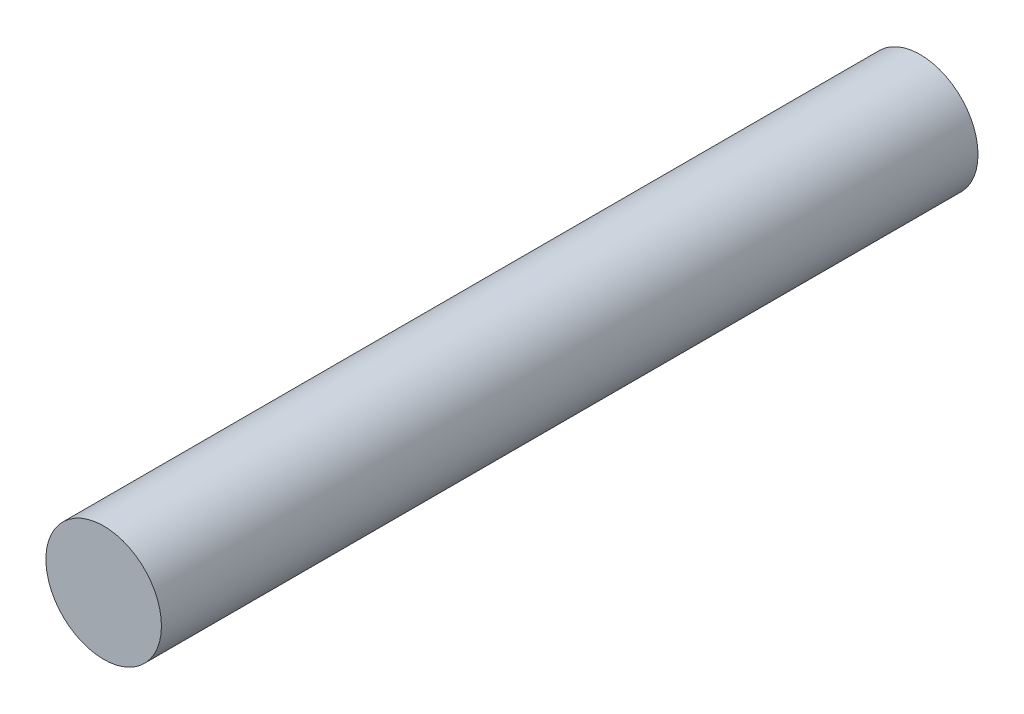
from build123d import *

# Parameters (mm, degrees)
SKETCH1_R      = 7.5
EXTRUDE1_DEPTH = 53


with BuildPart() as part:
    # Sketch1 → Extrude1 (new, symmetric)
    with BuildSketch(Plane.XY):
        with Locations((16.523655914, -216.779400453)):
            Circle(SKETCH1_R)
    extrude(amount=EXTRUDE1_DEPTH, both=True)


solid = part.part
